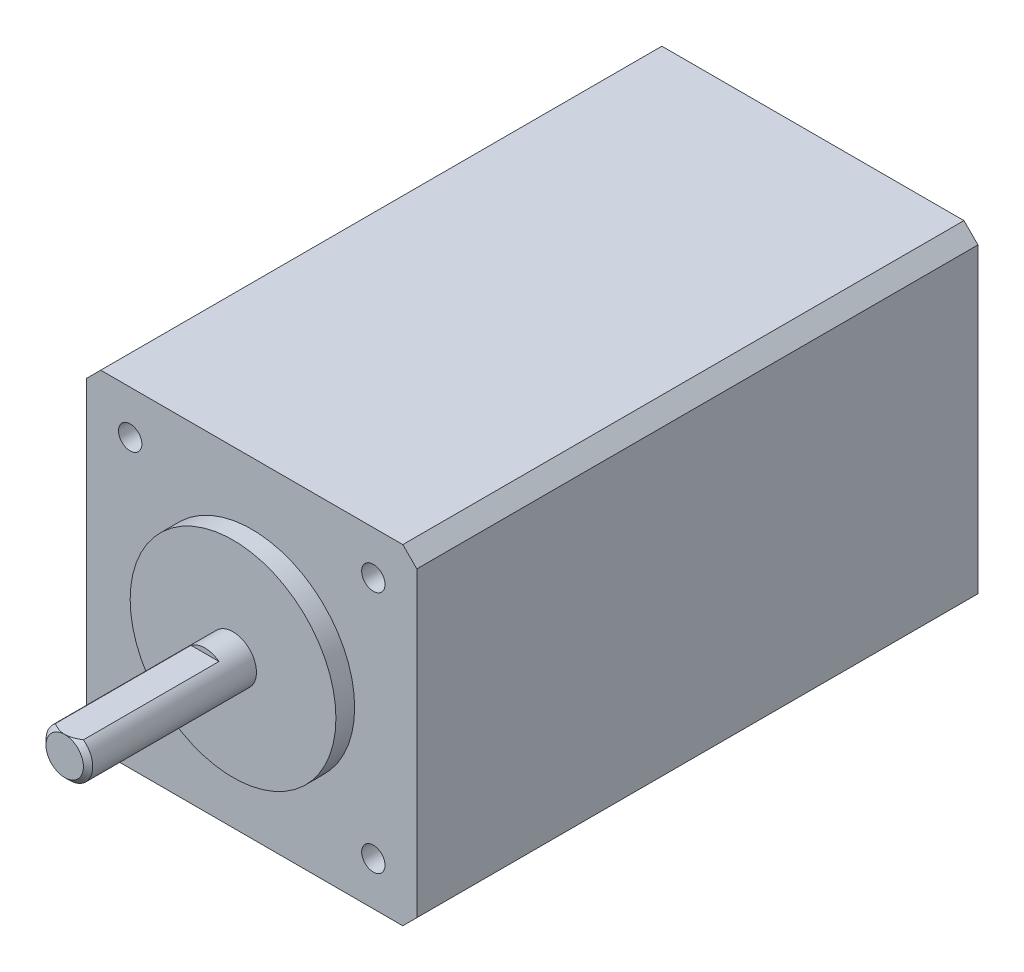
ISO-10303-21;
HEADER;
FILE_DESCRIPTION(('STEP AP214'),'2;1');
FILE_NAME('part.step','',(''),(''),'','','');
FILE_SCHEMA(('AUTOMOTIVE_DESIGN { 1 0 10303 214 1 1 1 1 }'));
ENDSEC;
DATA;
#1=APPLICATION_CONTEXT('core data for automotive mechanical design processes');
#2=APPLICATION_PROTOCOL_DEFINITION('international standard','automotive_design',2000,#1);
#3=PRODUCT_CONTEXT('',#1,'mechanical');
#4=PRODUCT('Part','Part','',(#3));
#5=PRODUCT_RELATED_PRODUCT_CATEGORY('part','',(#4));
#6=PRODUCT_DEFINITION_FORMATION('','',#4);
#7=PRODUCT_DEFINITION_CONTEXT('part definition',#1,'design');
#8=PRODUCT_DEFINITION('design','',#6,#7);
#9=PRODUCT_DEFINITION_SHAPE('','',#8);
#10=(LENGTH_UNIT() NAMED_UNIT(*) SI_UNIT(.MILLI.,.METRE.));
#11=(NAMED_UNIT(*) PLANE_ANGLE_UNIT() SI_UNIT($,.RADIAN.));
#12=(NAMED_UNIT(*) SI_UNIT($,.STERADIAN.) SOLID_ANGLE_UNIT());
#13=UNCERTAINTY_MEASURE_WITH_UNIT(LENGTH_MEASURE(1.E-05),#10,'distance_accuracy_value','');
#14=(GEOMETRIC_REPRESENTATION_CONTEXT(3) GLOBAL_UNCERTAINTY_ASSIGNED_CONTEXT((#13)) GLOBAL_UNIT_ASSIGNED_CONTEXT((#10,
#11,#12)) REPRESENTATION_CONTEXT('',''));
#15=CARTESIAN_POINT('',(0.,0.,0.));
#16=DIRECTION('',(0.,0.,1.));
#17=DIRECTION('',(1.,0.,0.));
#18=AXIS2_PLACEMENT_3D('',#15,#16,#17);
#19=CARTESIAN_POINT('',(0.,0.,0.));
#20=DIRECTION('',(0.,0.,1.));
#21=DIRECTION('',(1.,0.,0.));
#22=AXIS2_PLACEMENT_3D('',#19,#20,#21);
#23=PLANE('',#22);
#24=CARTESIAN_POINT('',(0.,0.,0.));
#25=DIRECTION('',(0.,0.,1.));
#26=DIRECTION('',(1.,0.,0.));
#27=AXIS2_PLACEMENT_3D('',#24,#25,#26);
#28=CIRCLE('',#27,11.);
#29=CARTESIAN_POINT('',(11.,0.,0.));
#30=VERTEX_POINT('',#29);
#31=EDGE_CURVE('E232',#30,#30,#28,.T.);
#32=ORIENTED_EDGE('',*,*,#31,.T.);
#33=EDGE_LOOP('',(#32));
#34=FACE_BOUND('',#33,.T.);
#35=CARTESIAN_POINT('',(0.,0.,0.));
#36=DIRECTION('',(0.,0.,1.));
#37=DIRECTION('',(1.,0.,0.));
#38=AXIS2_PLACEMENT_3D('',#35,#36,#37);
#39=CIRCLE('',#38,2.5);
#40=CARTESIAN_POINT('',(2.5,0.,0.));
#41=VERTEX_POINT('',#40);
#42=EDGE_CURVE('E229',#41,#41,#39,.T.);
#43=ORIENTED_EDGE('',*,*,#42,.F.);
#44=EDGE_LOOP('',(#43));
#45=FACE_BOUND('',#44,.T.);
#46=ADVANCED_FACE('F39',(#34,#45),#23,.T.);
#47=CARTESIAN_POINT('',(0.,0.,-2.));
#48=DIRECTION('',(0.,0.,1.));
#49=DIRECTION('',(1.,0.,0.));
#50=AXIS2_PLACEMENT_3D('',#47,#48,#49);
#51=CYLINDRICAL_SURFACE('',#50,11.);
#52=CARTESIAN_POINT('',(0.,0.,-2.));
#53=DIRECTION('',(0.,0.,1.));
#54=DIRECTION('',(1.,0.,0.));
#55=AXIS2_PLACEMENT_3D('',#52,#53,#54);
#56=CIRCLE('',#55,11.);
#57=CARTESIAN_POINT('',(11.,0.,-2.));
#58=VERTEX_POINT('',#57);
#59=EDGE_CURVE('E219',#58,#58,#56,.F.);
#60=ORIENTED_EDGE('',*,*,#59,.F.);
#61=EDGE_LOOP('',(#60));
#62=FACE_BOUND('',#61,.T.);
#63=ORIENTED_EDGE('',*,*,#31,.F.);
#64=EDGE_LOOP('',(#63));
#65=FACE_BOUND('',#64,.T.);
#66=ADVANCED_FACE('F265',(#62,#65),#51,.T.);
#67=CARTESIAN_POINT('',(0.,0.,18.));
#68=DIRECTION('',(0.,0.,-1.));
#69=DIRECTION('',(-1.,0.,0.));
#70=AXIS2_PLACEMENT_3D('',#67,#68,#69);
#71=CYLINDRICAL_SURFACE('',#70,2.5);
#72=DIRECTION('',(0.,0.,-1.));
#73=VECTOR('',#72,1.);
#74=CARTESIAN_POINT('',(1.5,2.,18.));
#75=LINE('',#74,#73);
#76=CARTESIAN_POINT('',(1.5,2.,3.));
#77=VERTEX_POINT('',#76);
#78=CARTESIAN_POINT('',(1.5,2.,17.5));
#79=VERTEX_POINT('',#78);
#80=EDGE_CURVE('E225',#77,#79,#75,.F.);
#81=ORIENTED_EDGE('',*,*,#80,.T.);
#82=CARTESIAN_POINT('',(0.,0.,17.5));
#83=DIRECTION('',(0.,0.,1.));
#84=DIRECTION('',(1.,0.,0.));
#85=AXIS2_PLACEMENT_3D('',#82,#83,#84);
#86=CIRCLE('',#85,2.5);
#87=CARTESIAN_POINT('',(-1.5,2.,17.5));
#88=VERTEX_POINT('',#87);
#89=EDGE_CURVE('E11',#79,#88,#86,.F.);
#90=ORIENTED_EDGE('',*,*,#89,.T.);
#91=DIRECTION('',(0.,0.,-1.));
#92=VECTOR('',#91,1.);
#93=CARTESIAN_POINT('',(-1.5,2.,18.));
#94=LINE('',#93,#92);
#95=CARTESIAN_POINT('',(-1.5,2.,3.));
#96=VERTEX_POINT('',#95);
#97=EDGE_CURVE('E227',#88,#96,#94,.T.);
#98=ORIENTED_EDGE('',*,*,#97,.T.);
#99=CARTESIAN_POINT('',(0.,0.,3.));
#100=DIRECTION('',(0.,0.,1.));
#101=DIRECTION('',(1.,0.,0.));
#102=AXIS2_PLACEMENT_3D('',#99,#100,#101);
#103=CIRCLE('',#102,2.5);
#104=EDGE_CURVE('E235',#77,#96,#103,.T.);
#105=ORIENTED_EDGE('',*,*,#104,.F.);
#106=EDGE_LOOP('',(#81,#90,#98,#105));
#107=FACE_BOUND('',#106,.T.);
#108=ORIENTED_EDGE('',*,*,#42,.T.);
#109=EDGE_LOOP('',(#108));
#110=FACE_BOUND('',#109,.T.);
#111=ADVANCED_FACE('F261',(#107,#110),#71,.T.);
#112=CARTESIAN_POINT('',(0.,0.,18.));
#113=DIRECTION('',(0.,0.,1.));
#114=DIRECTION('',(1.,0.,0.));
#115=AXIS2_PLACEMENT_3D('',#112,#113,#114);
#116=PLANE('',#115);
#117=CARTESIAN_POINT('',(0.,0.,18.));
#118=DIRECTION('',(0.,0.,1.));
#119=DIRECTION('',(1.,0.,0.));
#120=AXIS2_PLACEMENT_3D('',#117,#118,#119);
#121=CIRCLE('',#120,1.99999999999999);
#122=CARTESIAN_POINT('',(0.,2.,18.));
#123=VERTEX_POINT('',#122);
#124=EDGE_CURVE('E238',#123,#123,#121,.T.);
#125=ORIENTED_EDGE('',*,*,#124,.T.);
#126=EDGE_LOOP('',(#125));
#127=FACE_BOUND('',#126,.T.);
#128=ADVANCED_FACE('F257',(#127),#116,.T.);
#129=CARTESIAN_POINT('',(0.,0.,3.));
#130=DIRECTION('',(0.,0.,1.));
#131=DIRECTION('',(1.,0.,0.));
#132=AXIS2_PLACEMENT_3D('',#129,#130,#131);
#133=PLANE('',#132);
#134=ORIENTED_EDGE('',*,*,#104,.T.);
#135=DIRECTION('',(1.,0.,0.));
#136=VECTOR('',#135,1.);
#137=CARTESIAN_POINT('',(-3.25447574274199,2.,3.));
#138=LINE('',#137,#136);
#139=EDGE_CURVE('E222',#96,#77,#138,.T.);
#140=ORIENTED_EDGE('',*,*,#139,.T.);
#141=EDGE_LOOP('',(#134,#140));
#142=FACE_BOUND('',#141,.T.);
#143=ADVANCED_FACE('F255',(#142),#133,.T.);
#144=CARTESIAN_POINT('',(0.,2.,3.));
#145=DIRECTION('',(0.,-1.,0.));
#146=DIRECTION('',(0.,0.,-1.));
#147=AXIS2_PLACEMENT_3D('',#144,#145,#146);
#148=PLANE('',#147);
#149=CARTESIAN_POINT('',(-1.5,2.,17.5));
#150=CARTESIAN_POINT('',(-1.42763018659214,2.,17.5433736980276));
#151=CARTESIAN_POINT('',(-1.35436226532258,2.,17.5853687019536));
#152=CARTESIAN_POINT('',(-1.20549660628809,2.,17.6656443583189));
#153=CARTESIAN_POINT('',(-1.12989157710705,2.,17.7039114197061));
#154=CARTESIAN_POINT('',(-0.978296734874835,2.,17.7745341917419));
#155=CARTESIAN_POINT('',(-0.902366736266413,2.,17.8070165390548));
#156=CARTESIAN_POINT('',(-0.748220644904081,2.,17.8658090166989));
#157=CARTESIAN_POINT('',(-0.670007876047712,2.,17.8921276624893));
#158=CARTESIAN_POINT('',(-0.543060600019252,2.,17.9280861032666));
#159=CARTESIAN_POINT('',(-0.49502116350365,2.,17.9401901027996));
#160=CARTESIAN_POINT('',(-0.398260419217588,2.,17.9612794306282));
#161=CARTESIAN_POINT('',(-0.349539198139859,2.,17.9702651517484));
#162=CARTESIAN_POINT('',(-0.25085217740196,2.,17.984927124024));
#163=CARTESIAN_POINT('',(-0.20087865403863,2.,17.9905520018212));
#164=CARTESIAN_POINT('',(-0.100607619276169,2.,17.9981023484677));
#165=CARTESIAN_POINT('',(-0.050309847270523,2.,18.0000243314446));
#166=CARTESIAN_POINT('',(0.,2.,18.));
#167=B_SPLINE_CURVE_WITH_KNOTS('',3,(#149,#150,#151,#152,#153,#154,#155,#156,#157,#158,#159,
#160,#161,#162,#163,#164,#165,#166),.UNSPECIFIED.,.F.,.F.,(4,2,2,2,2,2,2,2,4),(0.,
0.253195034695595,0.507281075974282,0.75483775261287,1.00205037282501,1.15058504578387,
1.29910100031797,1.44983263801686,1.600706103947),.UNSPECIFIED.);
#168=EDGE_CURVE('E241',#88,#123,#167,.T.);
#169=ORIENTED_EDGE('',*,*,#168,.T.);
#170=CARTESIAN_POINT('',(0.,1.99999999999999,18.));
#171=CARTESIAN_POINT('',(0.0614966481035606,2.,18.0000514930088));
#172=CARTESIAN_POINT('',(0.122961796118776,2.,17.997164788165));
#173=CARTESIAN_POINT('',(0.245274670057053,2.,17.9859212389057));
#174=CARTESIAN_POINT('',(0.306123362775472,2.,17.9775750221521));
#175=CARTESIAN_POINT('',(0.425885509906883,2.,17.9559969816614));
#176=CARTESIAN_POINT('',(0.484814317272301,2.,17.9428488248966));
#177=CARTESIAN_POINT('',(0.601555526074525,2.,17.9122507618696));
#178=CARTESIAN_POINT('',(0.659367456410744,2.,17.8947990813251));
#179=CARTESIAN_POINT('',(0.784576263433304,2.,17.8525702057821));
#180=CARTESIAN_POINT('',(0.851714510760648,2.,17.8270315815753));
#181=CARTESIAN_POINT('',(0.984250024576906,2.,17.7717452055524));
#182=CARTESIAN_POINT('',(1.04964642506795,2.,17.7419954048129));
#183=CARTESIAN_POINT('',(1.18016546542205,2.,17.6784785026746));
#184=CARTESIAN_POINT('',(1.24525271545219,2.,17.6446394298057));
#185=CARTESIAN_POINT('',(1.37378197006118,2.,17.5742160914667));
#186=CARTESIAN_POINT('',(1.43722666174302,2.,17.5376367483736));
#187=CARTESIAN_POINT('',(1.5,2.,17.5));
#188=B_SPLINE_CURVE_WITH_KNOTS('',3,(#170,#171,#172,#173,#174,#175,#176,#177,#178,#179,#180,
#181,#182,#183,#184,#185,#186,#187),.UNSPECIFIED.,.F.,.F.,(4,2,2,2,2,2,2,2,4),(0.,
0.184371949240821,0.36838605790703,0.549336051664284,0.730360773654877,0.945674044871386,
1.16109243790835,1.38109142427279,1.60070428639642),.UNSPECIFIED.);
#189=EDGE_CURVE('E48',#123,#79,#188,.T.);
#190=ORIENTED_EDGE('',*,*,#189,.T.);
#191=ORIENTED_EDGE('',*,*,#80,.F.);
#192=ORIENTED_EDGE('',*,*,#139,.F.);
#193=ORIENTED_EDGE('',*,*,#97,.F.);
#194=EDGE_LOOP('',(#169,#190,#191,#192,#193));
#195=FACE_BOUND('',#194,.T.);
#196=ADVANCED_FACE('F249',(#195),#148,.F.);
#197=CARTESIAN_POINT('',(17.65,-16.15,-62.));
#198=DIRECTION('',(-1.,0.,0.));
#199=DIRECTION('',(0.,0.,1.));
#200=AXIS2_PLACEMENT_3D('',#197,#198,#199);
#201=PLANE('',#200);
#202=DIRECTION('',(0.,-1.,0.));
#203=VECTOR('',#202,1.);
#204=CARTESIAN_POINT('',(17.65,-16.15,-2.));
#205=LINE('',#204,#203);
#206=CARTESIAN_POINT('',(17.65,16.15,-2.));
#207=VERTEX_POINT('',#206);
#208=CARTESIAN_POINT('',(17.65,-16.15,-2.));
#209=VERTEX_POINT('',#208);
#210=EDGE_CURVE('E160',#207,#209,#205,.T.);
#211=ORIENTED_EDGE('',*,*,#210,.T.);
#212=DIRECTION('',(0.,0.,1.));
#213=VECTOR('',#212,1.);
#214=CARTESIAN_POINT('',(17.65,-16.15,-62.));
#215=LINE('',#214,#213);
#216=CARTESIAN_POINT('',(17.65,-16.15,-62.));
#217=VERTEX_POINT('',#216);
#218=EDGE_CURVE('E216',#217,#209,#215,.T.);
#219=ORIENTED_EDGE('',*,*,#218,.F.);
#220=DIRECTION('',(0.,-1.,0.));
#221=VECTOR('',#220,1.);
#222=CARTESIAN_POINT('',(17.65,-16.15,-62.));
#223=LINE('',#222,#221);
#224=CARTESIAN_POINT('',(17.65,16.15,-62.));
#225=VERTEX_POINT('',#224);
#226=EDGE_CURVE('E161',#225,#217,#223,.T.);
#227=ORIENTED_EDGE('',*,*,#226,.F.);
#228=DIRECTION('',(0.,0.,1.));
#229=VECTOR('',#228,1.);
#230=CARTESIAN_POINT('',(17.65,16.15,-62.));
#231=LINE('',#230,#229);
#232=EDGE_CURVE('E179',#225,#207,#231,.T.);
#233=ORIENTED_EDGE('',*,*,#232,.T.);
#234=EDGE_LOOP('',(#211,#219,#227,#233));
#235=FACE_BOUND('',#234,.T.);
#236=ADVANCED_FACE('F254',(#235),#201,.F.);
#237=CARTESIAN_POINT('',(16.15,-17.65,-62.));
#238=DIRECTION('',(-0.707106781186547,0.707106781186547,0.));
#239=DIRECTION('',(-0.707106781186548,-0.707106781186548,0.));
#240=AXIS2_PLACEMENT_3D('',#237,#238,#239);
#241=PLANE('',#240);
#242=DIRECTION('',(-0.707106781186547,-0.707106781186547,0.));
#243=VECTOR('',#242,1.);
#244=CARTESIAN_POINT('',(16.15,-17.65,-2.));
#245=LINE('',#244,#243);
#246=CARTESIAN_POINT('',(16.15,-17.65,-2.));
#247=VERTEX_POINT('',#246);
#248=EDGE_CURVE('E182',#209,#247,#245,.T.);
#249=ORIENTED_EDGE('',*,*,#248,.T.);
#250=DIRECTION('',(0.,0.,1.));
#251=VECTOR('',#250,1.);
#252=CARTESIAN_POINT('',(16.15,-17.65,-62.));
#253=LINE('',#252,#251);
#254=CARTESIAN_POINT('',(16.15,-17.65,-62.));
#255=VERTEX_POINT('',#254);
#256=EDGE_CURVE('E213',#255,#247,#253,.T.);
#257=ORIENTED_EDGE('',*,*,#256,.F.);
#258=DIRECTION('',(-0.707106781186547,-0.707106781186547,0.));
#259=VECTOR('',#258,1.);
#260=CARTESIAN_POINT('',(16.15,-17.65,-62.));
#261=LINE('',#260,#259);
#262=EDGE_CURVE('E164',#217,#255,#261,.T.);
#263=ORIENTED_EDGE('',*,*,#262,.F.);
#264=ORIENTED_EDGE('',*,*,#218,.T.);
#265=EDGE_LOOP('',(#249,#257,#263,#264));
#266=FACE_BOUND('',#265,.T.);
#267=ADVANCED_FACE('F321',(#266),#241,.F.);
#268=CARTESIAN_POINT('',(-16.15,-17.65,-62.));
#269=DIRECTION('',(0.,1.,0.));
#270=DIRECTION('',(-1.,0.,0.));
#271=AXIS2_PLACEMENT_3D('',#268,#269,#270);
#272=PLANE('',#271);
#273=DIRECTION('',(-1.,0.,0.));
#274=VECTOR('',#273,1.);
#275=CARTESIAN_POINT('',(-16.15,-17.65,-2.));
#276=LINE('',#275,#274);
#277=CARTESIAN_POINT('',(-16.15,-17.65,-2.));
#278=VERTEX_POINT('',#277);
#279=EDGE_CURVE('E184',#247,#278,#276,.T.);
#280=ORIENTED_EDGE('',*,*,#279,.T.);
#281=DIRECTION('',(0.,0.,1.));
#282=VECTOR('',#281,1.);
#283=CARTESIAN_POINT('',(-16.15,-17.65,-62.));
#284=LINE('',#283,#282);
#285=CARTESIAN_POINT('',(-16.15,-17.65,-62.));
#286=VERTEX_POINT('',#285);
#287=EDGE_CURVE('E210',#286,#278,#284,.T.);
#288=ORIENTED_EDGE('',*,*,#287,.F.);
#289=DIRECTION('',(-1.,0.,0.));
#290=VECTOR('',#289,1.);
#291=CARTESIAN_POINT('',(-16.15,-17.65,-62.));
#292=LINE('',#291,#290);
#293=EDGE_CURVE('E167',#255,#286,#292,.T.);
#294=ORIENTED_EDGE('',*,*,#293,.F.);
#295=ORIENTED_EDGE('',*,*,#256,.T.);
#296=EDGE_LOOP('',(#280,#288,#294,#295));
#297=FACE_BOUND('',#296,.T.);
#298=ADVANCED_FACE('F318',(#297),#272,.F.);
#299=CARTESIAN_POINT('',(-17.65,-16.15,-62.));
#300=DIRECTION('',(0.707106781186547,0.707106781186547,0.));
#301=DIRECTION('',(-0.707106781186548,0.707106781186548,0.));
#302=AXIS2_PLACEMENT_3D('',#299,#300,#301);
#303=PLANE('',#302);
#304=DIRECTION('',(-0.707106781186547,0.707106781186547,0.));
#305=VECTOR('',#304,1.);
#306=CARTESIAN_POINT('',(-17.65,-16.15,-2.));
#307=LINE('',#306,#305);
#308=CARTESIAN_POINT('',(-17.65,-16.15,-2.));
#309=VERTEX_POINT('',#308);
#310=EDGE_CURVE('E186',#278,#309,#307,.T.);
#311=ORIENTED_EDGE('',*,*,#310,.T.);
#312=DIRECTION('',(0.,0.,1.));
#313=VECTOR('',#312,1.);
#314=CARTESIAN_POINT('',(-17.65,-16.15,-62.));
#315=LINE('',#314,#313);
#316=CARTESIAN_POINT('',(-17.65,-16.15,-62.));
#317=VERTEX_POINT('',#316);
#318=EDGE_CURVE('E207',#317,#309,#315,.T.);
#319=ORIENTED_EDGE('',*,*,#318,.F.);
#320=DIRECTION('',(-0.707106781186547,0.707106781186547,0.));
#321=VECTOR('',#320,1.);
#322=CARTESIAN_POINT('',(-17.65,-16.15,-62.));
#323=LINE('',#322,#321);
#324=EDGE_CURVE('E169',#286,#317,#323,.T.);
#325=ORIENTED_EDGE('',*,*,#324,.F.);
#326=ORIENTED_EDGE('',*,*,#287,.T.);
#327=EDGE_LOOP('',(#311,#319,#325,#326));
#328=FACE_BOUND('',#327,.T.);
#329=ADVANCED_FACE('F313',(#328),#303,.F.);
#330=CARTESIAN_POINT('',(-17.65,16.15,-62.));
#331=DIRECTION('',(1.,0.,0.));
#332=DIRECTION('',(0.,1.,0.));
#333=AXIS2_PLACEMENT_3D('',#330,#331,#332);
#334=PLANE('',#333);
#335=DIRECTION('',(0.,1.,0.));
#336=VECTOR('',#335,1.);
#337=CARTESIAN_POINT('',(-17.65,16.15,-2.));
#338=LINE('',#337,#336);
#339=CARTESIAN_POINT('',(-17.65,16.15,-2.));
#340=VERTEX_POINT('',#339);
#341=EDGE_CURVE('E188',#309,#340,#338,.T.);
#342=ORIENTED_EDGE('',*,*,#341,.T.);
#343=DIRECTION('',(0.,0.,1.));
#344=VECTOR('',#343,1.);
#345=CARTESIAN_POINT('',(-17.65,16.15,-62.));
#346=LINE('',#345,#344);
#347=CARTESIAN_POINT('',(-17.65,16.15,-62.));
#348=VERTEX_POINT('',#347);
#349=EDGE_CURVE('E204',#348,#340,#346,.T.);
#350=ORIENTED_EDGE('',*,*,#349,.F.);
#351=DIRECTION('',(0.,1.,0.));
#352=VECTOR('',#351,1.);
#353=CARTESIAN_POINT('',(-17.65,16.15,-62.));
#354=LINE('',#353,#352);
#355=EDGE_CURVE('E171',#317,#348,#354,.T.);
#356=ORIENTED_EDGE('',*,*,#355,.F.);
#357=ORIENTED_EDGE('',*,*,#318,.T.);
#358=EDGE_LOOP('',(#342,#350,#356,#357));
#359=FACE_BOUND('',#358,.T.);
#360=ADVANCED_FACE('F309',(#359),#334,.F.);
#361=CARTESIAN_POINT('',(-16.15,17.65,-62.));
#362=DIRECTION('',(0.707106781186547,-0.707106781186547,0.));
#363=DIRECTION('',(0.707106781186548,0.707106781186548,0.));
#364=AXIS2_PLACEMENT_3D('',#361,#362,#363);
#365=PLANE('',#364);
#366=DIRECTION('',(0.707106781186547,0.707106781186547,0.));
#367=VECTOR('',#366,1.);
#368=CARTESIAN_POINT('',(-16.15,17.65,-2.));
#369=LINE('',#368,#367);
#370=CARTESIAN_POINT('',(-16.15,17.65,-2.));
#371=VERTEX_POINT('',#370);
#372=EDGE_CURVE('E190',#340,#371,#369,.T.);
#373=ORIENTED_EDGE('',*,*,#372,.T.);
#374=DIRECTION('',(0.,0.,1.));
#375=VECTOR('',#374,1.);
#376=CARTESIAN_POINT('',(-16.15,17.65,-62.));
#377=LINE('',#376,#375);
#378=CARTESIAN_POINT('',(-16.15,17.65,-62.));
#379=VERTEX_POINT('',#378);
#380=EDGE_CURVE('E201',#379,#371,#377,.T.);
#381=ORIENTED_EDGE('',*,*,#380,.F.);
#382=DIRECTION('',(0.707106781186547,0.707106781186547,0.));
#383=VECTOR('',#382,1.);
#384=CARTESIAN_POINT('',(-16.15,17.65,-62.));
#385=LINE('',#384,#383);
#386=EDGE_CURVE('E173',#348,#379,#385,.T.);
#387=ORIENTED_EDGE('',*,*,#386,.F.);
#388=ORIENTED_EDGE('',*,*,#349,.T.);
#389=EDGE_LOOP('',(#373,#381,#387,#388));
#390=FACE_BOUND('',#389,.T.);
#391=ADVANCED_FACE('F304',(#390),#365,.F.);
#392=CARTESIAN_POINT('',(16.15,17.65,-62.));
#393=DIRECTION('',(0.,-1.,0.));
#394=DIRECTION('',(1.,0.,0.));
#395=AXIS2_PLACEMENT_3D('',#392,#393,#394);
#396=PLANE('',#395);
#397=DIRECTION('',(1.,0.,0.));
#398=VECTOR('',#397,1.);
#399=CARTESIAN_POINT('',(16.15,17.65,-2.));
#400=LINE('',#399,#398);
#401=CARTESIAN_POINT('',(16.15,17.65,-2.));
#402=VERTEX_POINT('',#401);
#403=EDGE_CURVE('E193',#371,#402,#400,.T.);
#404=ORIENTED_EDGE('',*,*,#403,.T.);
#405=DIRECTION('',(0.,0.,1.));
#406=VECTOR('',#405,1.);
#407=CARTESIAN_POINT('',(16.15,17.65,-62.));
#408=LINE('',#407,#406);
#409=CARTESIAN_POINT('',(16.15,17.65,-62.));
#410=VERTEX_POINT('',#409);
#411=EDGE_CURVE('E198',#410,#402,#408,.T.);
#412=ORIENTED_EDGE('',*,*,#411,.F.);
#413=DIRECTION('',(1.,0.,0.));
#414=VECTOR('',#413,1.);
#415=CARTESIAN_POINT('',(0.,17.65,-62.));
#416=LINE('',#415,#414);
#417=EDGE_CURVE('E175',#379,#410,#416,.T.);
#418=ORIENTED_EDGE('',*,*,#417,.F.);
#419=ORIENTED_EDGE('',*,*,#380,.T.);
#420=EDGE_LOOP('',(#404,#412,#418,#419));
#421=FACE_BOUND('',#420,.T.);
#422=ADVANCED_FACE('F299',(#421),#396,.F.);
#423=CARTESIAN_POINT('',(17.65,16.15,-62.));
#424=DIRECTION('',(-0.707106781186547,-0.707106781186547,0.));
#425=DIRECTION('',(0.707106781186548,-0.707106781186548,0.));
#426=AXIS2_PLACEMENT_3D('',#423,#424,#425);
#427=PLANE('',#426);
#428=DIRECTION('',(0.707106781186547,-0.707106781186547,0.));
#429=VECTOR('',#428,1.);
#430=CARTESIAN_POINT('',(17.65,16.15,-2.));
#431=LINE('',#430,#429);
#432=EDGE_CURVE('E165',#402,#207,#431,.T.);
#433=ORIENTED_EDGE('',*,*,#432,.T.);
#434=ORIENTED_EDGE('',*,*,#232,.F.);
#435=DIRECTION('',(0.707106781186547,-0.707106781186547,0.));
#436=VECTOR('',#435,1.);
#437=CARTESIAN_POINT('',(17.65,16.15,-62.));
#438=LINE('',#437,#436);
#439=EDGE_CURVE('E177',#410,#225,#438,.T.);
#440=ORIENTED_EDGE('',*,*,#439,.F.);
#441=ORIENTED_EDGE('',*,*,#411,.T.);
#442=EDGE_LOOP('',(#433,#434,#440,#441));
#443=FACE_BOUND('',#442,.T.);
#444=ADVANCED_FACE('F295',(#443),#427,.F.);
#445=CARTESIAN_POINT('',(0.,0.,-62.));
#446=DIRECTION('',(0.,0.,1.));
#447=DIRECTION('',(1.,0.,0.));
#448=AXIS2_PLACEMENT_3D('',#445,#446,#447);
#449=PLANE('',#448);
#450=ORIENTED_EDGE('',*,*,#226,.T.);
#451=ORIENTED_EDGE('',*,*,#262,.T.);
#452=ORIENTED_EDGE('',*,*,#293,.T.);
#453=ORIENTED_EDGE('',*,*,#324,.T.);
#454=ORIENTED_EDGE('',*,*,#355,.T.);
#455=ORIENTED_EDGE('',*,*,#386,.T.);
#456=ORIENTED_EDGE('',*,*,#417,.T.);
#457=ORIENTED_EDGE('',*,*,#439,.T.);
#458=EDGE_LOOP('',(#450,#451,#452,#453,#454,#455,#456,#457));
#459=FACE_BOUND('',#458,.T.);
#460=ADVANCED_FACE('F283',(#459),#449,.F.);
#461=CARTESIAN_POINT('',(0.,0.,-2.));
#462=DIRECTION('',(0.,0.,1.));
#463=DIRECTION('',(1.,0.,0.));
#464=AXIS2_PLACEMENT_3D('',#461,#462,#463);
#465=PLANE('',#464);
#466=CARTESIAN_POINT('',(-13.,13.,-2.));
#467=DIRECTION('',(0.,0.,1.));
#468=DIRECTION('',(1.,0.,0.));
#469=AXIS2_PLACEMENT_3D('',#466,#467,#468);
#470=CIRCLE('',#469,1.25);
#471=CARTESIAN_POINT('',(-11.75,13.,-2.));
#472=VERTEX_POINT('',#471);
#473=EDGE_CURVE('E138',#472,#472,#470,.T.);
#474=ORIENTED_EDGE('',*,*,#473,.F.);
#475=EDGE_LOOP('',(#474));
#476=FACE_BOUND('',#475,.T.);
#477=CARTESIAN_POINT('',(13.,13.,-2.));
#478=DIRECTION('',(0.,0.,1.));
#479=DIRECTION('',(1.,0.,0.));
#480=AXIS2_PLACEMENT_3D('',#477,#478,#479);
#481=CIRCLE('',#480,1.25);
#482=CARTESIAN_POINT('',(14.25,13.,-2.));
#483=VERTEX_POINT('',#482);
#484=EDGE_CURVE('E137',#483,#483,#481,.T.);
#485=ORIENTED_EDGE('',*,*,#484,.F.);
#486=EDGE_LOOP('',(#485));
#487=FACE_BOUND('',#486,.T.);
#488=CARTESIAN_POINT('',(13.,-13.,-2.));
#489=DIRECTION('',(0.,0.,1.));
#490=DIRECTION('',(1.,0.,0.));
#491=AXIS2_PLACEMENT_3D('',#488,#489,#490);
#492=CIRCLE('',#491,1.25);
#493=CARTESIAN_POINT('',(14.25,-13.,-2.));
#494=VERTEX_POINT('',#493);
#495=EDGE_CURVE('E148',#494,#494,#492,.T.);
#496=ORIENTED_EDGE('',*,*,#495,.F.);
#497=EDGE_LOOP('',(#496));
#498=FACE_BOUND('',#497,.T.);
#499=CARTESIAN_POINT('',(-13.,-13.,-2.));
#500=DIRECTION('',(0.,0.,1.));
#501=DIRECTION('',(1.,0.,0.));
#502=AXIS2_PLACEMENT_3D('',#499,#500,#501);
#503=CIRCLE('',#502,1.25);
#504=CARTESIAN_POINT('',(-11.75,-13.,-2.));
#505=VERTEX_POINT('',#504);
#506=EDGE_CURVE('E154',#505,#505,#503,.T.);
#507=ORIENTED_EDGE('',*,*,#506,.F.);
#508=EDGE_LOOP('',(#507));
#509=FACE_BOUND('',#508,.T.);
#510=ORIENTED_EDGE('',*,*,#59,.T.);
#511=EDGE_LOOP('',(#510));
#512=FACE_BOUND('',#511,.T.);
#513=ORIENTED_EDGE('',*,*,#210,.F.);
#514=ORIENTED_EDGE('',*,*,#432,.F.);
#515=ORIENTED_EDGE('',*,*,#403,.F.);
#516=ORIENTED_EDGE('',*,*,#372,.F.);
#517=ORIENTED_EDGE('',*,*,#341,.F.);
#518=ORIENTED_EDGE('',*,*,#310,.F.);
#519=ORIENTED_EDGE('',*,*,#279,.F.);
#520=ORIENTED_EDGE('',*,*,#248,.F.);
#521=EDGE_LOOP('',(#513,#514,#515,#516,#517,#518,#519,#520));
#522=FACE_BOUND('',#521,.T.);
#523=ADVANCED_FACE('F279',(#476,#487,#498,#509,#512,#522),#465,.T.);
#524=CARTESIAN_POINT('',(-13.,-13.,-7.));
#525=DIRECTION('',(0.,0.,1.));
#526=DIRECTION('',(1.,0.,0.));
#527=AXIS2_PLACEMENT_3D('',#524,#525,#526);
#528=CONICAL_SURFACE('',#527,1.25,1.02974425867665);
#529=CARTESIAN_POINT('',(-13.,-13.,-7.75107577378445));
#530=VERTEX_POINT('',#529);
#531=VERTEX_LOOP('',#530);
#532=FACE_BOUND('',#531,.T.);
#533=CARTESIAN_POINT('',(-13.,-13.,-7.));
#534=DIRECTION('',(0.,0.,1.));
#535=DIRECTION('',(1.,0.,0.));
#536=AXIS2_PLACEMENT_3D('',#533,#534,#535);
#537=CIRCLE('',#536,1.25);
#538=CARTESIAN_POINT('',(-11.75,-13.,-7.));
#539=VERTEX_POINT('',#538);
#540=EDGE_CURVE('E157',#539,#539,#537,.T.);
#541=ORIENTED_EDGE('',*,*,#540,.T.);
#542=EDGE_LOOP('',(#541));
#543=FACE_BOUND('',#542,.T.);
#544=ADVANCED_FACE('F282',(#532,#543),#528,.F.);
#545=CARTESIAN_POINT('',(-13.,-13.,-2.));
#546=DIRECTION('',(0.,0.,1.));
#547=DIRECTION('',(1.,0.,0.));
#548=AXIS2_PLACEMENT_3D('',#545,#546,#547);
#549=CYLINDRICAL_SURFACE('',#548,1.25);
#550=ORIENTED_EDGE('',*,*,#540,.F.);
#551=EDGE_LOOP('',(#550));
#552=FACE_BOUND('',#551,.T.);
#553=ORIENTED_EDGE('',*,*,#506,.T.);
#554=EDGE_LOOP('',(#553));
#555=FACE_BOUND('',#554,.T.);
#556=ADVANCED_FACE('F397',(#552,#555),#549,.F.);
#557=CARTESIAN_POINT('',(13.,-13.,-7.));
#558=DIRECTION('',(0.,0.,1.));
#559=DIRECTION('',(1.,0.,0.));
#560=AXIS2_PLACEMENT_3D('',#557,#558,#559);
#561=CONICAL_SURFACE('',#560,1.25,1.02974425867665);
#562=CARTESIAN_POINT('',(13.,-13.,-7.75107577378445));
#563=VERTEX_POINT('',#562);
#564=VERTEX_LOOP('',#563);
#565=FACE_BOUND('',#564,.T.);
#566=CARTESIAN_POINT('',(13.,-13.,-7.));
#567=DIRECTION('',(0.,0.,1.));
#568=DIRECTION('',(1.,0.,0.));
#569=AXIS2_PLACEMENT_3D('',#566,#567,#568);
#570=CIRCLE('',#569,1.25);
#571=CARTESIAN_POINT('',(14.25,-13.,-7.));
#572=VERTEX_POINT('',#571);
#573=EDGE_CURVE('E151',#572,#572,#570,.T.);
#574=ORIENTED_EDGE('',*,*,#573,.T.);
#575=EDGE_LOOP('',(#574));
#576=FACE_BOUND('',#575,.T.);
#577=ADVANCED_FACE('F407',(#565,#576),#561,.F.);
#578=CARTESIAN_POINT('',(13.,-13.,-2.));
#579=DIRECTION('',(0.,0.,1.));
#580=DIRECTION('',(1.,0.,0.));
#581=AXIS2_PLACEMENT_3D('',#578,#579,#580);
#582=CYLINDRICAL_SURFACE('',#581,1.25);
#583=ORIENTED_EDGE('',*,*,#573,.F.);
#584=EDGE_LOOP('',(#583));
#585=FACE_BOUND('',#584,.T.);
#586=ORIENTED_EDGE('',*,*,#495,.T.);
#587=EDGE_LOOP('',(#586));
#588=FACE_BOUND('',#587,.T.);
#589=ADVANCED_FACE('F418',(#585,#588),#582,.F.);
#590=CARTESIAN_POINT('',(13.,13.,-7.));
#591=DIRECTION('',(0.,0.,1.));
#592=DIRECTION('',(1.,0.,0.));
#593=AXIS2_PLACEMENT_3D('',#590,#591,#592);
#594=CONICAL_SURFACE('',#593,1.25,1.02974425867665);
#595=CARTESIAN_POINT('',(13.,13.,-7.75107577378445));
#596=VERTEX_POINT('',#595);
#597=VERTEX_LOOP('',#596);
#598=FACE_BOUND('',#597,.T.);
#599=CARTESIAN_POINT('',(13.,13.,-7.));
#600=DIRECTION('',(0.,0.,1.));
#601=DIRECTION('',(1.,0.,0.));
#602=AXIS2_PLACEMENT_3D('',#599,#600,#601);
#603=CIRCLE('',#602,1.25);
#604=CARTESIAN_POINT('',(14.25,13.,-7.));
#605=VERTEX_POINT('',#604);
#606=EDGE_CURVE('E141',#605,#605,#603,.T.);
#607=ORIENTED_EDGE('',*,*,#606,.T.);
#608=EDGE_LOOP('',(#607));
#609=FACE_BOUND('',#608,.T.);
#610=ADVANCED_FACE('F428',(#598,#609),#594,.F.);
#611=CARTESIAN_POINT('',(13.,13.,-2.));
#612=DIRECTION('',(0.,0.,1.));
#613=DIRECTION('',(1.,0.,0.));
#614=AXIS2_PLACEMENT_3D('',#611,#612,#613);
#615=CYLINDRICAL_SURFACE('',#614,1.25);
#616=ORIENTED_EDGE('',*,*,#606,.F.);
#617=EDGE_LOOP('',(#616));
#618=FACE_BOUND('',#617,.T.);
#619=ORIENTED_EDGE('',*,*,#484,.T.);
#620=EDGE_LOOP('',(#619));
#621=FACE_BOUND('',#620,.T.);
#622=ADVANCED_FACE('F131',(#618,#621),#615,.F.);
#623=CARTESIAN_POINT('',(-13.,13.,-7.));
#624=DIRECTION('',(0.,0.,1.));
#625=DIRECTION('',(1.,0.,0.));
#626=AXIS2_PLACEMENT_3D('',#623,#624,#625);
#627=CONICAL_SURFACE('',#626,1.25,1.02974425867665);
#628=CARTESIAN_POINT('',(-13.,13.,-7.75107577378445));
#629=VERTEX_POINT('',#628);
#630=VERTEX_LOOP('',#629);
#631=FACE_BOUND('',#630,.T.);
#632=CARTESIAN_POINT('',(-13.,13.,-7.));
#633=DIRECTION('',(0.,0.,1.));
#634=DIRECTION('',(1.,0.,0.));
#635=AXIS2_PLACEMENT_3D('',#632,#633,#634);
#636=CIRCLE('',#635,1.25);
#637=CARTESIAN_POINT('',(-11.75,13.,-7.));
#638=VERTEX_POINT('',#637);
#639=EDGE_CURVE('E135',#638,#638,#636,.T.);
#640=ORIENTED_EDGE('',*,*,#639,.T.);
#641=EDGE_LOOP('',(#640));
#642=FACE_BOUND('',#641,.T.);
#643=ADVANCED_FACE('F127',(#631,#642),#627,.F.);
#644=CARTESIAN_POINT('',(-13.,13.,-2.));
#645=DIRECTION('',(0.,0.,1.));
#646=DIRECTION('',(1.,0.,0.));
#647=AXIS2_PLACEMENT_3D('',#644,#645,#646);
#648=CYLINDRICAL_SURFACE('',#647,1.25);
#649=ORIENTED_EDGE('',*,*,#639,.F.);
#650=EDGE_LOOP('',(#649));
#651=FACE_BOUND('',#650,.T.);
#652=ORIENTED_EDGE('',*,*,#473,.T.);
#653=EDGE_LOOP('',(#652));
#654=FACE_BOUND('',#653,.T.);
#655=ADVANCED_FACE('F130',(#651,#654),#648,.F.);
#656=CARTESIAN_POINT('',(0.,0.,18.));
#657=DIRECTION('',(0.,0.,-1.));
#658=DIRECTION('',(-1.,0.,0.));
#659=AXIS2_PLACEMENT_3D('',#656,#657,#658);
#660=CONICAL_SURFACE('',#659,1.99999999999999,0.785398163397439);
#661=ORIENTED_EDGE('',*,*,#168,.F.);
#662=ORIENTED_EDGE('',*,*,#89,.F.);
#663=ORIENTED_EDGE('',*,*,#189,.F.);
#664=ORIENTED_EDGE('',*,*,#124,.F.);
#665=EDGE_LOOP('',(#661,#662,#663,#664));
#666=FACE_BOUND('',#665,.T.);
#667=ADVANCED_FACE('F41',(#666),#660,.T.);
#668=CLOSED_SHELL('',(#46,#66,#111,#128,#143,#196,#236,#267,#298,#329,#360,#391,#422,#444,#460,
#523,#544,#556,#577,#589,#610,#622,#643,#655,#667));
#669=MANIFOLD_SOLID_BREP('B2',#668);
#670=ADVANCED_BREP_SHAPE_REPRESENTATION('',(#18,#669),#14);
#671=SHAPE_DEFINITION_REPRESENTATION(#9,#670);
ENDSEC;
END-ISO-10303-21;
